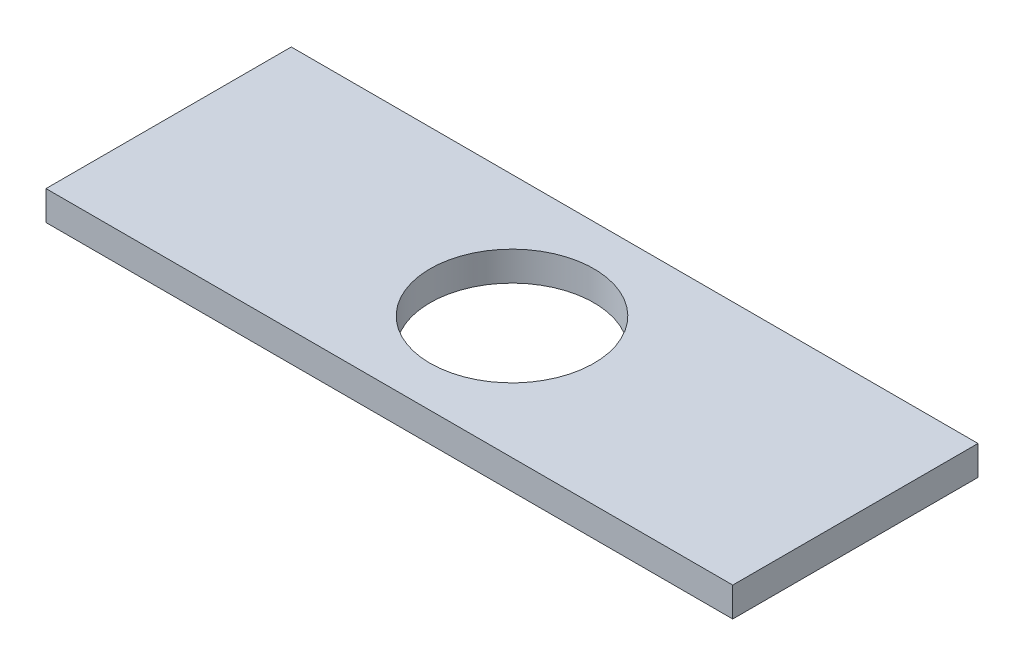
ISO-10303-21;
HEADER;
FILE_DESCRIPTION(('STEP AP214'),'2;1');
FILE_NAME('part.step','',(''),(''),'','','');
FILE_SCHEMA(('AUTOMOTIVE_DESIGN { 1 0 10303 214 1 1 1 1 }'));
ENDSEC;
DATA;
#1=APPLICATION_CONTEXT('core data for automotive mechanical design processes');
#2=APPLICATION_PROTOCOL_DEFINITION('international standard','automotive_design',2000,#1);
#3=PRODUCT_CONTEXT('',#1,'mechanical');
#4=PRODUCT('Part','Part','',(#3));
#5=PRODUCT_RELATED_PRODUCT_CATEGORY('part','',(#4));
#6=PRODUCT_DEFINITION_FORMATION('','',#4);
#7=PRODUCT_DEFINITION_CONTEXT('part definition',#1,'design');
#8=PRODUCT_DEFINITION('design','',#6,#7);
#9=PRODUCT_DEFINITION_SHAPE('','',#8);
#10=(LENGTH_UNIT() NAMED_UNIT(*) SI_UNIT(.MILLI.,.METRE.));
#11=(NAMED_UNIT(*) PLANE_ANGLE_UNIT() SI_UNIT($,.RADIAN.));
#12=(NAMED_UNIT(*) SI_UNIT($,.STERADIAN.) SOLID_ANGLE_UNIT());
#13=UNCERTAINTY_MEASURE_WITH_UNIT(LENGTH_MEASURE(1.E-05),#10,'distance_accuracy_value','');
#14=(GEOMETRIC_REPRESENTATION_CONTEXT(3) GLOBAL_UNCERTAINTY_ASSIGNED_CONTEXT((#13)) GLOBAL_UNIT_ASSIGNED_CONTEXT((#10,
#11,#12)) REPRESENTATION_CONTEXT('',''));
#15=CARTESIAN_POINT('',(0.,0.,0.));
#16=DIRECTION('',(0.,0.,1.));
#17=DIRECTION('',(1.,0.,0.));
#18=AXIS2_PLACEMENT_3D('',#15,#16,#17);
#19=CARTESIAN_POINT('',(-70.,6.,25.));
#20=DIRECTION('',(0.,1.,0.));
#21=DIRECTION('',(0.,0.,1.));
#22=AXIS2_PLACEMENT_3D('',#19,#20,#21);
#23=PLANE('',#22);
#24=DIRECTION('',(0.,0.,1.));
#25=VECTOR('',#24,1.);
#26=CARTESIAN_POINT('',(-70.,6.,-25.));
#27=LINE('',#26,#25);
#28=CARTESIAN_POINT('',(-70.,6.,-25.));
#29=VERTEX_POINT('',#28);
#30=CARTESIAN_POINT('',(-70.,6.,25.));
#31=VERTEX_POINT('',#30);
#32=EDGE_CURVE('E95',#29,#31,#27,.T.);
#33=ORIENTED_EDGE('',*,*,#32,.T.);
#34=DIRECTION('',(1.,0.,0.));
#35=VECTOR('',#34,1.);
#36=CARTESIAN_POINT('',(-70.,6.,25.));
#37=LINE('',#36,#35);
#38=CARTESIAN_POINT('',(70.,6.,25.));
#39=VERTEX_POINT('',#38);
#40=EDGE_CURVE('E80',#31,#39,#37,.T.);
#41=ORIENTED_EDGE('',*,*,#40,.T.);
#42=DIRECTION('',(0.,0.,-1.));
#43=VECTOR('',#42,1.);
#44=CARTESIAN_POINT('',(70.,6.,-25.));
#45=LINE('',#44,#43);
#46=CARTESIAN_POINT('',(70.,6.,-25.));
#47=VERTEX_POINT('',#46);
#48=EDGE_CURVE('E46',#39,#47,#45,.T.);
#49=ORIENTED_EDGE('',*,*,#48,.T.);
#50=DIRECTION('',(-1.,0.,0.));
#51=VECTOR('',#50,1.);
#52=CARTESIAN_POINT('',(-70.,6.,-25.));
#53=LINE('',#52,#51);
#54=EDGE_CURVE('E41',#47,#29,#53,.T.);
#55=ORIENTED_EDGE('',*,*,#54,.T.);
#56=EDGE_LOOP('',(#33,#41,#49,#55));
#57=FACE_BOUND('',#56,.T.);
#58=CARTESIAN_POINT('',(0.,6.,0.));
#59=DIRECTION('',(0.,1.,0.));
#60=DIRECTION('',(0.,0.,1.));
#61=AXIS2_PLACEMENT_3D('',#58,#59,#60);
#62=CIRCLE('',#61,16.7);
#63=CARTESIAN_POINT('',(0.,6.,16.7));
#64=VERTEX_POINT('',#63);
#65=EDGE_CURVE('E85',#64,#64,#62,.T.);
#66=ORIENTED_EDGE('',*,*,#65,.F.);
#67=EDGE_LOOP('',(#66));
#68=FACE_BOUND('',#67,.T.);
#69=ADVANCED_FACE('F26',(#57,#68),#23,.T.);
#70=CARTESIAN_POINT('',(-70.,0.,25.));
#71=DIRECTION('',(0.,1.,0.));
#72=DIRECTION('',(0.,0.,1.));
#73=AXIS2_PLACEMENT_3D('',#70,#71,#72);
#74=PLANE('',#73);
#75=DIRECTION('',(0.,0.,1.));
#76=VECTOR('',#75,1.);
#77=CARTESIAN_POINT('',(-70.,0.,-25.));
#78=LINE('',#77,#76);
#79=CARTESIAN_POINT('',(-70.,0.,-25.));
#80=VERTEX_POINT('',#79);
#81=CARTESIAN_POINT('',(-70.,0.,25.));
#82=VERTEX_POINT('',#81);
#83=EDGE_CURVE('E72',#80,#82,#78,.T.);
#84=ORIENTED_EDGE('',*,*,#83,.F.);
#85=DIRECTION('',(-1.,0.,0.));
#86=VECTOR('',#85,1.);
#87=CARTESIAN_POINT('',(-70.,0.,-25.));
#88=LINE('',#87,#86);
#89=CARTESIAN_POINT('',(70.,0.,-25.));
#90=VERTEX_POINT('',#89);
#91=EDGE_CURVE('E93',#90,#80,#88,.T.);
#92=ORIENTED_EDGE('',*,*,#91,.F.);
#93=DIRECTION('',(0.,0.,-1.));
#94=VECTOR('',#93,1.);
#95=CARTESIAN_POINT('',(70.,0.,-25.));
#96=LINE('',#95,#94);
#97=CARTESIAN_POINT('',(70.,0.,25.));
#98=VERTEX_POINT('',#97);
#99=EDGE_CURVE('E73',#98,#90,#96,.T.);
#100=ORIENTED_EDGE('',*,*,#99,.F.);
#101=DIRECTION('',(1.,0.,0.));
#102=VECTOR('',#101,1.);
#103=CARTESIAN_POINT('',(-70.,0.,25.));
#104=LINE('',#103,#102);
#105=EDGE_CURVE('E67',#82,#98,#104,.T.);
#106=ORIENTED_EDGE('',*,*,#105,.F.);
#107=EDGE_LOOP('',(#84,#92,#100,#106));
#108=FACE_BOUND('',#107,.T.);
#109=CARTESIAN_POINT('',(0.,0.,0.));
#110=DIRECTION('',(0.,1.,0.));
#111=DIRECTION('',(0.,0.,1.));
#112=AXIS2_PLACEMENT_3D('',#109,#110,#111);
#113=CIRCLE('',#112,16.7);
#114=CARTESIAN_POINT('',(0.,0.,16.7));
#115=VERTEX_POINT('',#114);
#116=EDGE_CURVE('E88',#115,#115,#113,.T.);
#117=ORIENTED_EDGE('',*,*,#116,.T.);
#118=EDGE_LOOP('',(#117));
#119=FACE_BOUND('',#118,.T.);
#120=ADVANCED_FACE('F68',(#108,#119),#74,.F.);
#121=CARTESIAN_POINT('',(-70.,6.,-25.));
#122=DIRECTION('',(1.,0.,0.));
#123=DIRECTION('',(0.,0.,-1.));
#124=AXIS2_PLACEMENT_3D('',#121,#122,#123);
#125=PLANE('',#124);
#126=ORIENTED_EDGE('',*,*,#83,.T.);
#127=DIRECTION('',(0.,-1.,0.));
#128=VECTOR('',#127,1.);
#129=CARTESIAN_POINT('',(-70.,6.,25.));
#130=LINE('',#129,#128);
#131=EDGE_CURVE('E11',#31,#82,#130,.T.);
#132=ORIENTED_EDGE('',*,*,#131,.F.);
#133=ORIENTED_EDGE('',*,*,#32,.F.);
#134=DIRECTION('',(0.,-1.,0.));
#135=VECTOR('',#134,1.);
#136=CARTESIAN_POINT('',(-70.,6.,-25.));
#137=LINE('',#136,#135);
#138=EDGE_CURVE('E84',#29,#80,#137,.T.);
#139=ORIENTED_EDGE('',*,*,#138,.T.);
#140=EDGE_LOOP('',(#126,#132,#133,#139));
#141=FACE_BOUND('',#140,.T.);
#142=ADVANCED_FACE('F28',(#141),#125,.F.);
#143=CARTESIAN_POINT('',(-70.,6.,25.));
#144=DIRECTION('',(0.,0.,-1.));
#145=DIRECTION('',(-1.,0.,0.));
#146=AXIS2_PLACEMENT_3D('',#143,#144,#145);
#147=PLANE('',#146);
#148=ORIENTED_EDGE('',*,*,#105,.T.);
#149=DIRECTION('',(0.,-1.,0.));
#150=VECTOR('',#149,1.);
#151=CARTESIAN_POINT('',(70.,6.,25.));
#152=LINE('',#151,#150);
#153=EDGE_CURVE('E34',#39,#98,#152,.T.);
#154=ORIENTED_EDGE('',*,*,#153,.F.);
#155=ORIENTED_EDGE('',*,*,#40,.F.);
#156=ORIENTED_EDGE('',*,*,#131,.T.);
#157=EDGE_LOOP('',(#148,#154,#155,#156));
#158=FACE_BOUND('',#157,.T.);
#159=ADVANCED_FACE('F79',(#158),#147,.F.);
#160=CARTESIAN_POINT('',(70.,6.,-25.));
#161=DIRECTION('',(-1.,0.,0.));
#162=DIRECTION('',(0.,0.,1.));
#163=AXIS2_PLACEMENT_3D('',#160,#161,#162);
#164=PLANE('',#163);
#165=ORIENTED_EDGE('',*,*,#99,.T.);
#166=DIRECTION('',(0.,-1.,0.));
#167=VECTOR('',#166,1.);
#168=CARTESIAN_POINT('',(70.,6.,-25.));
#169=LINE('',#168,#167);
#170=EDGE_CURVE('E101',#47,#90,#169,.T.);
#171=ORIENTED_EDGE('',*,*,#170,.F.);
#172=ORIENTED_EDGE('',*,*,#48,.F.);
#173=ORIENTED_EDGE('',*,*,#153,.T.);
#174=EDGE_LOOP('',(#165,#171,#172,#173));
#175=FACE_BOUND('',#174,.T.);
#176=ADVANCED_FACE('F104',(#175),#164,.F.);
#177=CARTESIAN_POINT('',(-70.,6.,-25.));
#178=DIRECTION('',(0.,0.,1.));
#179=DIRECTION('',(1.,0.,0.));
#180=AXIS2_PLACEMENT_3D('',#177,#178,#179);
#181=PLANE('',#180);
#182=ORIENTED_EDGE('',*,*,#91,.T.);
#183=ORIENTED_EDGE('',*,*,#138,.F.);
#184=ORIENTED_EDGE('',*,*,#54,.F.);
#185=ORIENTED_EDGE('',*,*,#170,.T.);
#186=EDGE_LOOP('',(#182,#183,#184,#185));
#187=FACE_BOUND('',#186,.T.);
#188=ADVANCED_FACE('F106',(#187),#181,.F.);
#189=CARTESIAN_POINT('',(0.,6.,0.));
#190=DIRECTION('',(0.,-1.,0.));
#191=DIRECTION('',(0.,0.,-1.));
#192=AXIS2_PLACEMENT_3D('',#189,#190,#191);
#193=CYLINDRICAL_SURFACE('',#192,16.7);
#194=ORIENTED_EDGE('',*,*,#65,.T.);
#195=EDGE_LOOP('',(#194));
#196=FACE_BOUND('',#195,.T.);
#197=ORIENTED_EDGE('',*,*,#116,.F.);
#198=EDGE_LOOP('',(#197));
#199=FACE_BOUND('',#198,.T.);
#200=ADVANCED_FACE('F112',(#196,#199),#193,.F.);
#201=CLOSED_SHELL('',(#69,#120,#142,#159,#176,#188,#200));
#202=MANIFOLD_SOLID_BREP('B2',#201);
#203=ADVANCED_BREP_SHAPE_REPRESENTATION('',(#18,#202),#14);
#204=SHAPE_DEFINITION_REPRESENTATION(#9,#203);
ENDSEC;
END-ISO-10303-21;
